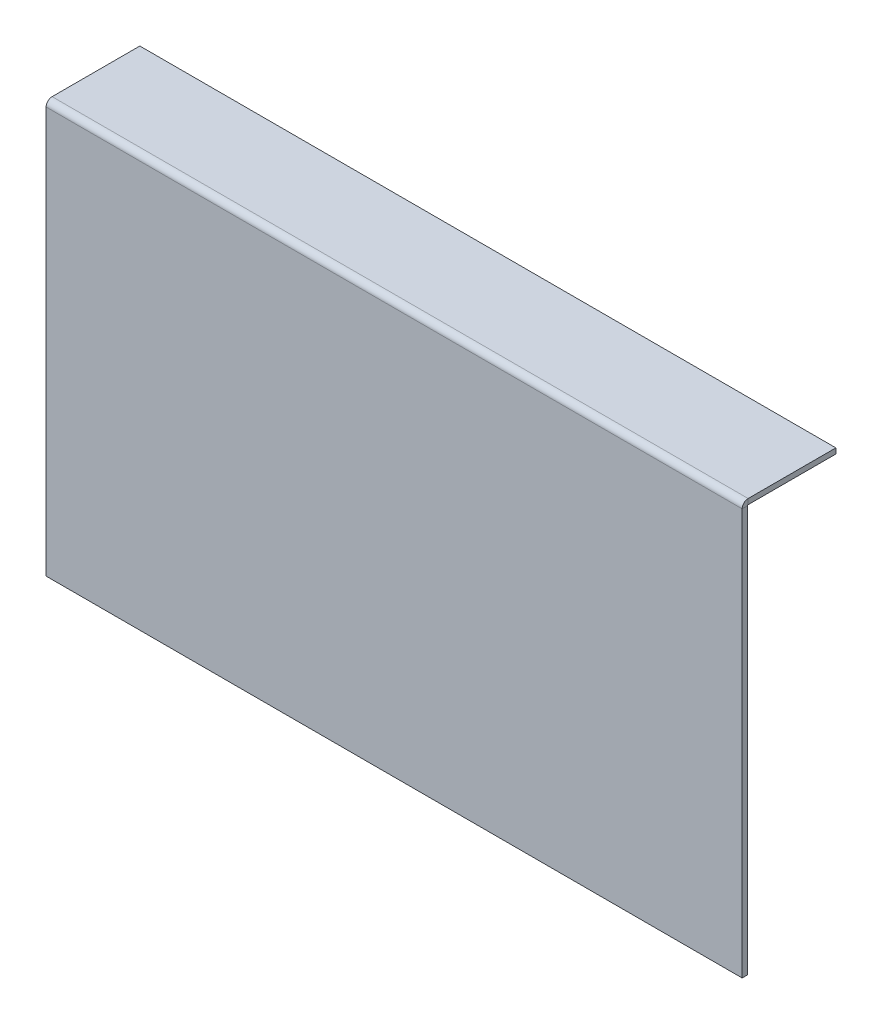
ISO-10303-21;
HEADER;
FILE_DESCRIPTION(('STEP AP214'),'2;1');
FILE_NAME('part.step','',(''),(''),'','','');
FILE_SCHEMA(('AUTOMOTIVE_DESIGN { 1 0 10303 214 1 1 1 1 }'));
ENDSEC;
DATA;
#1=APPLICATION_CONTEXT('core data for automotive mechanical design processes');
#2=APPLICATION_PROTOCOL_DEFINITION('international standard','automotive_design',2000,#1);
#3=PRODUCT_CONTEXT('',#1,'mechanical');
#4=PRODUCT('Part','Part','',(#3));
#5=PRODUCT_RELATED_PRODUCT_CATEGORY('part','',(#4));
#6=PRODUCT_DEFINITION_FORMATION('','',#4);
#7=PRODUCT_DEFINITION_CONTEXT('part definition',#1,'design');
#8=PRODUCT_DEFINITION('design','',#6,#7);
#9=PRODUCT_DEFINITION_SHAPE('','',#8);
#10=(LENGTH_UNIT() NAMED_UNIT(*) SI_UNIT(.MILLI.,.METRE.));
#11=(NAMED_UNIT(*) PLANE_ANGLE_UNIT() SI_UNIT($,.RADIAN.));
#12=(NAMED_UNIT(*) SI_UNIT($,.STERADIAN.) SOLID_ANGLE_UNIT());
#13=UNCERTAINTY_MEASURE_WITH_UNIT(LENGTH_MEASURE(1.E-05),#10,'distance_accuracy_value','');
#14=(GEOMETRIC_REPRESENTATION_CONTEXT(3) GLOBAL_UNCERTAINTY_ASSIGNED_CONTEXT((#13)) GLOBAL_UNIT_ASSIGNED_CONTEXT((#10,
#11,#12)) REPRESENTATION_CONTEXT('',''));
#15=CARTESIAN_POINT('',(0.,0.,0.));
#16=DIRECTION('',(0.,0.,1.));
#17=DIRECTION('',(1.,0.,0.));
#18=AXIS2_PLACEMENT_3D('',#15,#16,#17);
#19=CARTESIAN_POINT('',(412.75,-244.475,6.35));
#20=DIRECTION('',(-1.,0.,0.));
#21=DIRECTION('',(0.,0.,1.));
#22=AXIS2_PLACEMENT_3D('',#19,#20,#21);
#23=PLANE('',#22);
#24=DIRECTION('',(0.,0.,1.));
#25=VECTOR('',#24,1.);
#26=CARTESIAN_POINT('',(412.75,237.3884,0.));
#27=LINE('',#26,#25);
#28=CARTESIAN_POINT('',(412.75,237.3884,0.));
#29=VERTEX_POINT('',#28);
#30=CARTESIAN_POINT('',(412.75,237.3884,6.35));
#31=VERTEX_POINT('',#30);
#32=EDGE_CURVE('E104',#29,#31,#27,.T.);
#33=ORIENTED_EDGE('',*,*,#32,.T.);
#34=DIRECTION('',(0.,1.,0.));
#35=VECTOR('',#34,1.);
#36=CARTESIAN_POINT('',(412.75,-244.475,6.35));
#37=LINE('',#36,#35);
#38=CARTESIAN_POINT('',(412.75,-244.475,6.35));
#39=VERTEX_POINT('',#38);
#40=EDGE_CURVE('E92',#39,#31,#37,.T.);
#41=ORIENTED_EDGE('',*,*,#40,.F.);
#42=DIRECTION('',(0.,0.,-1.));
#43=VECTOR('',#42,1.);
#44=CARTESIAN_POINT('',(412.75,-244.475,6.35));
#45=LINE('',#44,#43);
#46=CARTESIAN_POINT('',(412.75,-244.475,0.));
#47=VERTEX_POINT('',#46);
#48=EDGE_CURVE('E59',#39,#47,#45,.T.);
#49=ORIENTED_EDGE('',*,*,#48,.T.);
#50=DIRECTION('',(0.,1.,0.));
#51=VECTOR('',#50,1.);
#52=CARTESIAN_POINT('',(412.75,-244.475,0.));
#53=LINE('',#52,#51);
#54=EDGE_CURVE('E97',#47,#29,#53,.T.);
#55=ORIENTED_EDGE('',*,*,#54,.T.);
#56=EDGE_LOOP('',(#33,#41,#49,#55));
#57=FACE_BOUND('',#56,.T.);
#58=ADVANCED_FACE('F52',(#57),#23,.F.);
#59=CARTESIAN_POINT('',(-412.75,-244.475,6.35));
#60=DIRECTION('',(1.,0.,0.));
#61=DIRECTION('',(0.,0.,-1.));
#62=AXIS2_PLACEMENT_3D('',#59,#60,#61);
#63=PLANE('',#62);
#64=DIRECTION('',(0.,0.,1.));
#65=VECTOR('',#64,1.);
#66=CARTESIAN_POINT('',(-412.75,237.3884,0.));
#67=LINE('',#66,#65);
#68=CARTESIAN_POINT('',(-412.75,237.3884,0.));
#69=VERTEX_POINT('',#68);
#70=CARTESIAN_POINT('',(-412.75,237.3884,6.35));
#71=VERTEX_POINT('',#70);
#72=EDGE_CURVE('E100',#69,#71,#67,.T.);
#73=ORIENTED_EDGE('',*,*,#72,.F.);
#74=DIRECTION('',(0.,-1.,0.));
#75=VECTOR('',#74,1.);
#76=CARTESIAN_POINT('',(-412.75,-244.475,0.));
#77=LINE('',#76,#75);
#78=CARTESIAN_POINT('',(-412.75,-244.475,0.));
#79=VERTEX_POINT('',#78);
#80=EDGE_CURVE('E93',#69,#79,#77,.T.);
#81=ORIENTED_EDGE('',*,*,#80,.T.);
#82=DIRECTION('',(0.,0.,-1.));
#83=VECTOR('',#82,1.);
#84=CARTESIAN_POINT('',(-412.75,-244.475,6.35));
#85=LINE('',#84,#83);
#86=CARTESIAN_POINT('',(-412.75,-244.475,6.35));
#87=VERTEX_POINT('',#86);
#88=EDGE_CURVE('E13',#87,#79,#85,.T.);
#89=ORIENTED_EDGE('',*,*,#88,.F.);
#90=DIRECTION('',(0.,-1.,0.));
#91=VECTOR('',#90,1.);
#92=CARTESIAN_POINT('',(-412.75,-244.475,6.35));
#93=LINE('',#92,#91);
#94=EDGE_CURVE('E108',#71,#87,#93,.T.);
#95=ORIENTED_EDGE('',*,*,#94,.F.);
#96=EDGE_LOOP('',(#73,#81,#89,#95));
#97=FACE_BOUND('',#96,.T.);
#98=ADVANCED_FACE('F208',(#97),#63,.F.);
#99=CARTESIAN_POINT('',(412.75,244.475,6.35));
#100=DIRECTION('',(0.,0.,-1.));
#101=DIRECTION('',(-1.,0.,0.));
#102=AXIS2_PLACEMENT_3D('',#99,#100,#101);
#103=PLANE('',#102);
#104=DIRECTION('',(1.,0.,0.));
#105=VECTOR('',#104,1.);
#106=CARTESIAN_POINT('',(412.75,237.3884,6.35));
#107=LINE('',#106,#105);
#108=EDGE_CURVE('E124',#31,#71,#107,.F.);
#109=ORIENTED_EDGE('',*,*,#108,.T.);
#110=ORIENTED_EDGE('',*,*,#94,.T.);
#111=DIRECTION('',(1.,0.,0.));
#112=VECTOR('',#111,1.);
#113=CARTESIAN_POINT('',(-412.75,-244.475,6.35));
#114=LINE('',#113,#112);
#115=EDGE_CURVE('E75',#87,#39,#114,.T.);
#116=ORIENTED_EDGE('',*,*,#115,.T.);
#117=ORIENTED_EDGE('',*,*,#40,.T.);
#118=EDGE_LOOP('',(#109,#110,#116,#117));
#119=FACE_BOUND('',#118,.T.);
#120=ADVANCED_FACE('F203',(#119),#103,.F.);
#121=CARTESIAN_POINT('',(412.75,244.475,0.));
#122=DIRECTION('',(0.,0.,-1.));
#123=DIRECTION('',(-1.,0.,0.));
#124=AXIS2_PLACEMENT_3D('',#121,#122,#123);
#125=PLANE('',#124);
#126=ORIENTED_EDGE('',*,*,#80,.F.);
#127=DIRECTION('',(1.,0.,0.));
#128=VECTOR('',#127,1.);
#129=CARTESIAN_POINT('',(412.75,237.3884,0.));
#130=LINE('',#129,#128);
#131=EDGE_CURVE('E66',#29,#69,#130,.F.);
#132=ORIENTED_EDGE('',*,*,#131,.F.);
#133=ORIENTED_EDGE('',*,*,#54,.F.);
#134=DIRECTION('',(1.,0.,0.));
#135=VECTOR('',#134,1.);
#136=CARTESIAN_POINT('',(-412.75,-244.475,0.));
#137=LINE('',#136,#135);
#138=EDGE_CURVE('E87',#79,#47,#137,.T.);
#139=ORIENTED_EDGE('',*,*,#138,.F.);
#140=EDGE_LOOP('',(#126,#132,#133,#139));
#141=FACE_BOUND('',#140,.T.);
#142=ADVANCED_FACE('F99',(#141),#125,.T.);
#143=CARTESIAN_POINT('',(-412.75,-244.475,6.35));
#144=DIRECTION('',(0.,1.,0.));
#145=DIRECTION('',(0.,0.,1.));
#146=AXIS2_PLACEMENT_3D('',#143,#144,#145);
#147=PLANE('',#146);
#148=ORIENTED_EDGE('',*,*,#138,.T.);
#149=ORIENTED_EDGE('',*,*,#48,.F.);
#150=ORIENTED_EDGE('',*,*,#115,.F.);
#151=ORIENTED_EDGE('',*,*,#88,.T.);
#152=EDGE_LOOP('',(#148,#149,#150,#151));
#153=FACE_BOUND('',#152,.T.);
#154=ADVANCED_FACE('F89',(#153),#147,.F.);
#155=CARTESIAN_POINT('',(-412.75,237.3884,-0.736600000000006));
#156=DIRECTION('',(-1.,0.,0.));
#157=DIRECTION('',(0.,0.,1.));
#158=AXIS2_PLACEMENT_3D('',#155,#156,#157);
#159=PLANE('',#158);
#160=DIRECTION('',(0.,-1.,0.));
#161=VECTOR('',#160,1.);
#162=CARTESIAN_POINT('',(-412.75,244.475,-0.736599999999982));
#163=LINE('',#162,#161);
#164=CARTESIAN_POINT('',(-412.75,238.125,-0.736600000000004));
#165=VERTEX_POINT('',#164);
#166=CARTESIAN_POINT('',(-412.75,244.475,-0.736599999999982));
#167=VERTEX_POINT('',#166);
#168=EDGE_CURVE('E129',#165,#167,#163,.F.);
#169=ORIENTED_EDGE('',*,*,#168,.F.);
#170=CARTESIAN_POINT('',(-412.75,237.3884,-0.736600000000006));
#171=DIRECTION('',(1.,0.,0.));
#172=DIRECTION('',(0.,0.,-1.));
#173=AXIS2_PLACEMENT_3D('',#170,#171,#172);
#174=CIRCLE('',#173,0.736600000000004);
#175=EDGE_CURVE('E118',#69,#165,#174,.F.);
#176=ORIENTED_EDGE('',*,*,#175,.F.);
#177=ORIENTED_EDGE('',*,*,#72,.T.);
#178=CARTESIAN_POINT('',(-412.75,237.3884,-0.736600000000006));
#179=DIRECTION('',(1.,0.,0.));
#180=DIRECTION('',(0.,0.,-1.));
#181=AXIS2_PLACEMENT_3D('',#178,#179,#180);
#182=CIRCLE('',#181,7.0866);
#183=EDGE_CURVE('E111',#71,#167,#182,.F.);
#184=ORIENTED_EDGE('',*,*,#183,.T.);
#185=EDGE_LOOP('',(#169,#176,#177,#184));
#186=FACE_BOUND('',#185,.T.);
#187=ADVANCED_FACE('F209',(#186),#159,.T.);
#188=CARTESIAN_POINT('',(412.75,237.3884,-0.736600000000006));
#189=DIRECTION('',(-1.,0.,0.));
#190=DIRECTION('',(0.,0.,1.));
#191=AXIS2_PLACEMENT_3D('',#188,#189,#190);
#192=PLANE('',#191);
#193=CARTESIAN_POINT('',(412.75,237.3884,-0.736600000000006));
#194=DIRECTION('',(1.,0.,0.));
#195=DIRECTION('',(0.,0.,-1.));
#196=AXIS2_PLACEMENT_3D('',#193,#194,#195);
#197=CIRCLE('',#196,0.736600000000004);
#198=CARTESIAN_POINT('',(412.75,238.125,-0.736600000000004));
#199=VERTEX_POINT('',#198);
#200=EDGE_CURVE('E113',#199,#29,#197,.T.);
#201=ORIENTED_EDGE('',*,*,#200,.F.);
#202=DIRECTION('',(0.,-1.,0.));
#203=VECTOR('',#202,1.);
#204=CARTESIAN_POINT('',(412.75,238.125,-0.736600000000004));
#205=LINE('',#204,#203);
#206=CARTESIAN_POINT('',(412.75,244.475,-0.736599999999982));
#207=VERTEX_POINT('',#206);
#208=EDGE_CURVE('E135',#199,#207,#205,.F.);
#209=ORIENTED_EDGE('',*,*,#208,.T.);
#210=CARTESIAN_POINT('',(412.75,237.3884,-0.736600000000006));
#211=DIRECTION('',(1.,0.,0.));
#212=DIRECTION('',(0.,0.,-1.));
#213=AXIS2_PLACEMENT_3D('',#210,#211,#212);
#214=CIRCLE('',#213,7.0866);
#215=EDGE_CURVE('E121',#207,#31,#214,.T.);
#216=ORIENTED_EDGE('',*,*,#215,.T.);
#217=ORIENTED_EDGE('',*,*,#32,.F.);
#218=EDGE_LOOP('',(#201,#209,#216,#217));
#219=FACE_BOUND('',#218,.T.);
#220=ADVANCED_FACE('F219',(#219),#192,.F.);
#221=CARTESIAN_POINT('',(412.75,237.3884,-0.736600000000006));
#222=DIRECTION('',(1.,0.,0.));
#223=DIRECTION('',(0.,1.,0.));
#224=AXIS2_PLACEMENT_3D('',#221,#222,#223);
#225=CYLINDRICAL_SURFACE('',#224,7.0866);
#226=ORIENTED_EDGE('',*,*,#108,.F.);
#227=ORIENTED_EDGE('',*,*,#215,.F.);
#228=DIRECTION('',(1.,0.,0.));
#229=VECTOR('',#228,1.);
#230=CARTESIAN_POINT('',(-412.75,244.475,-0.736599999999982));
#231=LINE('',#230,#229);
#232=EDGE_CURVE('E138',#207,#167,#231,.F.);
#233=ORIENTED_EDGE('',*,*,#232,.T.);
#234=ORIENTED_EDGE('',*,*,#183,.F.);
#235=EDGE_LOOP('',(#226,#227,#233,#234));
#236=FACE_BOUND('',#235,.T.);
#237=ADVANCED_FACE('F210',(#236),#225,.T.);
#238=CARTESIAN_POINT('',(412.75,237.3884,-0.736600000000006));
#239=DIRECTION('',(1.,0.,0.));
#240=DIRECTION('',(0.,1.,0.));
#241=AXIS2_PLACEMENT_3D('',#238,#239,#240);
#242=CYLINDRICAL_SURFACE('',#241,0.736600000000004);
#243=ORIENTED_EDGE('',*,*,#131,.T.);
#244=ORIENTED_EDGE('',*,*,#175,.T.);
#245=DIRECTION('',(1.,0.,0.));
#246=VECTOR('',#245,1.);
#247=CARTESIAN_POINT('',(-412.75,238.125,-0.736600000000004));
#248=LINE('',#247,#246);
#249=EDGE_CURVE('E132',#165,#199,#248,.T.);
#250=ORIENTED_EDGE('',*,*,#249,.T.);
#251=ORIENTED_EDGE('',*,*,#200,.T.);
#252=EDGE_LOOP('',(#243,#244,#250,#251));
#253=FACE_BOUND('',#252,.T.);
#254=ADVANCED_FACE('F221',(#253),#242,.F.);
#255=CARTESIAN_POINT('',(412.75,244.475,-104.775));
#256=DIRECTION('',(-1.,0.,0.));
#257=DIRECTION('',(0.,0.,1.));
#258=AXIS2_PLACEMENT_3D('',#255,#256,#257);
#259=PLANE('',#258);
#260=ORIENTED_EDGE('',*,*,#208,.F.);
#261=DIRECTION('',(0.,0.,1.));
#262=VECTOR('',#261,1.);
#263=CARTESIAN_POINT('',(412.75,238.125,-104.775));
#264=LINE('',#263,#262);
#265=CARTESIAN_POINT('',(412.75,238.125,-104.775));
#266=VERTEX_POINT('',#265);
#267=EDGE_CURVE('E141',#199,#266,#264,.F.);
#268=ORIENTED_EDGE('',*,*,#267,.T.);
#269=DIRECTION('',(0.,-1.,0.));
#270=VECTOR('',#269,1.);
#271=CARTESIAN_POINT('',(412.75,244.475,-104.775));
#272=LINE('',#271,#270);
#273=CARTESIAN_POINT('',(412.75,244.475,-104.775));
#274=VERTEX_POINT('',#273);
#275=EDGE_CURVE('E116',#274,#266,#272,.T.);
#276=ORIENTED_EDGE('',*,*,#275,.F.);
#277=DIRECTION('',(0.,0.,-1.));
#278=VECTOR('',#277,1.);
#279=CARTESIAN_POINT('',(412.75,244.475,0.));
#280=LINE('',#279,#278);
#281=EDGE_CURVE('E150',#207,#274,#280,.T.);
#282=ORIENTED_EDGE('',*,*,#281,.F.);
#283=EDGE_LOOP('',(#260,#268,#276,#282));
#284=FACE_BOUND('',#283,.T.);
#285=ADVANCED_FACE('F216',(#284),#259,.F.);
#286=CARTESIAN_POINT('',(-412.75,244.475,0.));
#287=DIRECTION('',(1.,0.,0.));
#288=DIRECTION('',(0.,0.,-1.));
#289=AXIS2_PLACEMENT_3D('',#286,#287,#288);
#290=PLANE('',#289);
#291=ORIENTED_EDGE('',*,*,#168,.T.);
#292=DIRECTION('',(0.,0.,1.));
#293=VECTOR('',#292,1.);
#294=CARTESIAN_POINT('',(-412.75,244.475,0.));
#295=LINE('',#294,#293);
#296=CARTESIAN_POINT('',(-412.75,244.475,-104.775));
#297=VERTEX_POINT('',#296);
#298=EDGE_CURVE('E156',#297,#167,#295,.T.);
#299=ORIENTED_EDGE('',*,*,#298,.F.);
#300=DIRECTION('',(0.,-1.,0.));
#301=VECTOR('',#300,1.);
#302=CARTESIAN_POINT('',(-412.75,244.475,-104.775));
#303=LINE('',#302,#301);
#304=CARTESIAN_POINT('',(-412.75,238.125,-104.775));
#305=VERTEX_POINT('',#304);
#306=EDGE_CURVE('E159',#297,#305,#303,.T.);
#307=ORIENTED_EDGE('',*,*,#306,.T.);
#308=DIRECTION('',(0.,0.,-1.));
#309=VECTOR('',#308,1.);
#310=CARTESIAN_POINT('',(-412.75,238.125,0.));
#311=LINE('',#310,#309);
#312=EDGE_CURVE('E147',#305,#165,#311,.F.);
#313=ORIENTED_EDGE('',*,*,#312,.T.);
#314=EDGE_LOOP('',(#291,#299,#307,#313));
#315=FACE_BOUND('',#314,.T.);
#316=ADVANCED_FACE('F185',(#315),#290,.F.);
#317=CARTESIAN_POINT('',(-412.75,244.475,0.));
#318=DIRECTION('',(0.,-1.,0.));
#319=DIRECTION('',(0.,0.,-1.));
#320=AXIS2_PLACEMENT_3D('',#317,#318,#319);
#321=PLANE('',#320);
#322=ORIENTED_EDGE('',*,*,#232,.F.);
#323=ORIENTED_EDGE('',*,*,#281,.T.);
#324=DIRECTION('',(-1.,0.,0.));
#325=VECTOR('',#324,1.);
#326=CARTESIAN_POINT('',(-412.75,244.475,-104.775));
#327=LINE('',#326,#325);
#328=EDGE_CURVE('E153',#274,#297,#327,.T.);
#329=ORIENTED_EDGE('',*,*,#328,.T.);
#330=ORIENTED_EDGE('',*,*,#298,.T.);
#331=EDGE_LOOP('',(#322,#323,#329,#330));
#332=FACE_BOUND('',#331,.T.);
#333=ADVANCED_FACE('F213',(#332),#321,.F.);
#334=CARTESIAN_POINT('',(-412.75,238.125,0.));
#335=DIRECTION('',(0.,-1.,0.));
#336=DIRECTION('',(0.,0.,-1.));
#337=AXIS2_PLACEMENT_3D('',#334,#335,#336);
#338=PLANE('',#337);
#339=ORIENTED_EDGE('',*,*,#267,.F.);
#340=ORIENTED_EDGE('',*,*,#249,.F.);
#341=ORIENTED_EDGE('',*,*,#312,.F.);
#342=DIRECTION('',(1.,0.,0.));
#343=VECTOR('',#342,1.);
#344=CARTESIAN_POINT('',(-412.75,238.125,-104.775));
#345=LINE('',#344,#343);
#346=EDGE_CURVE('E144',#266,#305,#345,.F.);
#347=ORIENTED_EDGE('',*,*,#346,.F.);
#348=EDGE_LOOP('',(#339,#340,#341,#347));
#349=FACE_BOUND('',#348,.T.);
#350=ADVANCED_FACE('F179',(#349),#338,.T.);
#351=CARTESIAN_POINT('',(-412.75,244.475,-104.775));
#352=DIRECTION('',(0.,0.,1.));
#353=DIRECTION('',(0.,-1.,0.));
#354=AXIS2_PLACEMENT_3D('',#351,#352,#353);
#355=PLANE('',#354);
#356=ORIENTED_EDGE('',*,*,#346,.T.);
#357=ORIENTED_EDGE('',*,*,#306,.F.);
#358=ORIENTED_EDGE('',*,*,#328,.F.);
#359=ORIENTED_EDGE('',*,*,#275,.T.);
#360=EDGE_LOOP('',(#356,#357,#358,#359));
#361=FACE_BOUND('',#360,.T.);
#362=ADVANCED_FACE('F168',(#361),#355,.F.);
#363=CLOSED_SHELL('',(#58,#98,#120,#142,#154,#187,#220,#237,#254,#285,#316,#333,#350,#362));
#364=MANIFOLD_SOLID_BREP('B2',#363);
#365=ADVANCED_BREP_SHAPE_REPRESENTATION('',(#18,#364),#14);
#366=SHAPE_DEFINITION_REPRESENTATION(#9,#365);
ENDSEC;
END-ISO-10303-21;
